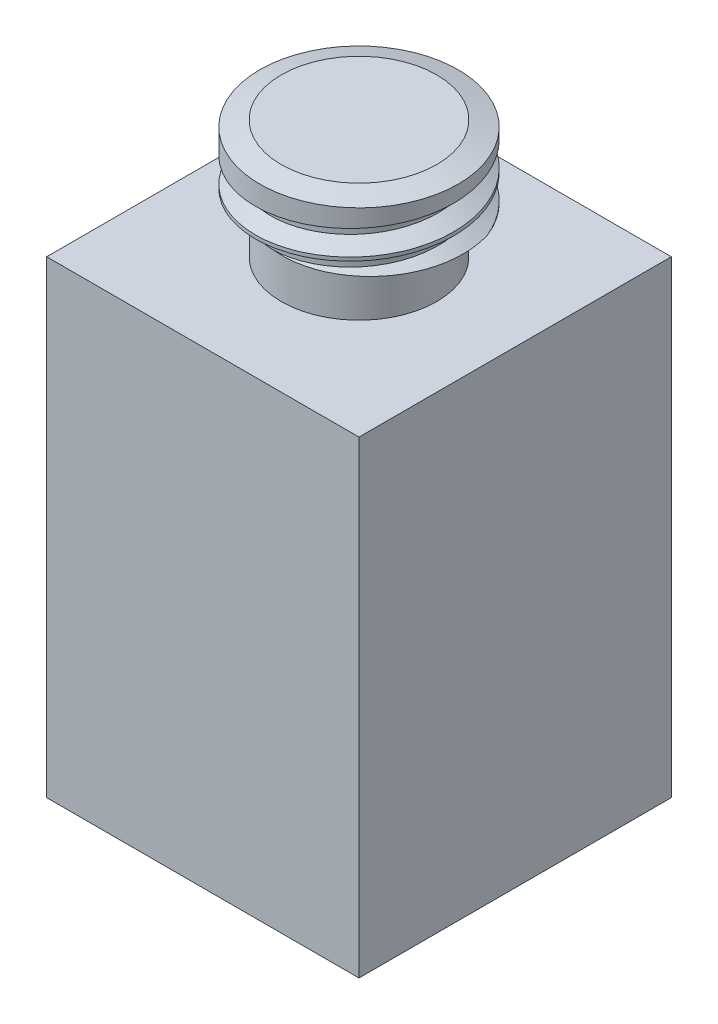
ISO-10303-21;
HEADER;
FILE_DESCRIPTION(('STEP AP214'),'2;1');
FILE_NAME('part.step','',(''),(''),'','','');
FILE_SCHEMA(('AUTOMOTIVE_DESIGN { 1 0 10303 214 1 1 1 1 }'));
ENDSEC;
DATA;
#1=APPLICATION_CONTEXT('core data for automotive mechanical design processes');
#2=APPLICATION_PROTOCOL_DEFINITION('international standard','automotive_design',2000,#1);
#3=PRODUCT_CONTEXT('',#1,'mechanical');
#4=PRODUCT('Part','Part','',(#3));
#5=PRODUCT_RELATED_PRODUCT_CATEGORY('part','',(#4));
#6=PRODUCT_DEFINITION_FORMATION('','',#4);
#7=PRODUCT_DEFINITION_CONTEXT('part definition',#1,'design');
#8=PRODUCT_DEFINITION('design','',#6,#7);
#9=PRODUCT_DEFINITION_SHAPE('','',#8);
#10=(LENGTH_UNIT() NAMED_UNIT(*) SI_UNIT(.MILLI.,.METRE.));
#11=(NAMED_UNIT(*) PLANE_ANGLE_UNIT() SI_UNIT($,.RADIAN.));
#12=(NAMED_UNIT(*) SI_UNIT($,.STERADIAN.) SOLID_ANGLE_UNIT());
#13=UNCERTAINTY_MEASURE_WITH_UNIT(LENGTH_MEASURE(1.E-05),#10,'distance_accuracy_value','');
#14=(GEOMETRIC_REPRESENTATION_CONTEXT(3) GLOBAL_UNCERTAINTY_ASSIGNED_CONTEXT((#13)) GLOBAL_UNIT_ASSIGNED_CONTEXT((#10,
#11,#12)) REPRESENTATION_CONTEXT('',''));
#15=CARTESIAN_POINT('',(0.,0.,0.));
#16=DIRECTION('',(0.,0.,1.));
#17=DIRECTION('',(1.,0.,0.));
#18=AXIS2_PLACEMENT_3D('',#15,#16,#17);
#19=CARTESIAN_POINT('',(0.,16.5,0.));
#20=DIRECTION('',(0.,1.,0.));
#21=DIRECTION('',(0.,0.,1.));
#22=AXIS2_PLACEMENT_3D('',#19,#20,#21);
#23=PLANE('',#22);
#24=CARTESIAN_POINT('',(0.,16.5,0.));
#25=DIRECTION('',(0.,1.,0.));
#26=DIRECTION('',(0.,0.,1.));
#27=AXIS2_PLACEMENT_3D('',#24,#25,#26);
#28=CIRCLE('',#27,2.4892);
#29=CARTESIAN_POINT('',(0.,16.5,2.4892));
#30=VERTEX_POINT('',#29);
#31=EDGE_CURVE('E161',#30,#30,#28,.T.);
#32=ORIENTED_EDGE('',*,*,#31,.T.);
#33=EDGE_LOOP('',(#32));
#34=FACE_BOUND('',#33,.T.);
#35=CARTESIAN_POINT('',(1.25907616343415,16.5,-2.91467874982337));
#36=CARTESIAN_POINT('',(1.17500574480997,16.5,-2.94321576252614));
#37=CARTESIAN_POINT('',(1.08972726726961,16.5,-2.9681925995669));
#38=CARTESIAN_POINT('',(0.917386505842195,16.5,-3.01088530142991));
#39=CARTESIAN_POINT('',(0.83032451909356,16.5,-3.02860236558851));
#40=CARTESIAN_POINT('',(0.654842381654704,16.5,-3.05667297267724));
#41=CARTESIAN_POINT('',(0.566419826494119,16.5,-3.0670114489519));
#42=CARTESIAN_POINT('',(0.388996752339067,16.5,-3.0802008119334));
#43=CARTESIAN_POINT('',(0.299996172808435,16.5,-3.08305090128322));
#44=CARTESIAN_POINT('',(0.166504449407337,16.5,-3.08168500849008));
#45=CARTESIAN_POINT('',(0.121967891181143,16.5,-3.08028566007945));
#46=CARTESIAN_POINT('',(0.0329930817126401,16.5,-3.0756239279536));
#47=CARTESIAN_POINT('',(-0.0114451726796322,16.5,-3.07236160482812));
#48=CARTESIAN_POINT('',(-0.144460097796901,16.5,-3.05957565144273));
#49=CARTESIAN_POINT('',(-0.23276865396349,16.5,-3.0470528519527));
#50=CARTESIAN_POINT('',(-0.407760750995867,16.5,-3.01414433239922));
#51=CARTESIAN_POINT('',(-0.494446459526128,16.5,-2.99377002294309));
#52=CARTESIAN_POINT('',(-0.665648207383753,16.5,-2.94531083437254));
#53=CARTESIAN_POINT('',(-0.750164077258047,16.5,-2.91722535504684));
#54=CARTESIAN_POINT('',(-0.912140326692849,16.5,-2.85517508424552));
#55=CARTESIAN_POINT('',(-0.989741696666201,16.5,-2.82157748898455));
#56=CARTESIAN_POINT('',(-1.14179099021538,16.5,-2.74787775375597));
#57=CARTESIAN_POINT('',(-1.21623898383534,16.5,-2.70777575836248));
#58=CARTESIAN_POINT('',(-1.36150337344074,16.5,-2.62131996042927));
#59=CARTESIAN_POINT('',(-1.4323164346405,16.5,-2.57496055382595));
#60=CARTESIAN_POINT('',(-1.56972323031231,16.5,-2.4763546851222));
#61=CARTESIAN_POINT('',(-1.6363166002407,16.5,-2.42410771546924));
#62=CARTESIAN_POINT('',(-1.76395276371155,16.5,-2.31483573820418));
#63=CARTESIAN_POINT('',(-1.82505738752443,16.5,-2.25788317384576));
#64=CARTESIAN_POINT('',(-1.91292405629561,16.5,-2.16875391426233));
#65=CARTESIAN_POINT('',(-1.94158341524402,16.5,-2.13842480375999));
#66=CARTESIAN_POINT('',(-1.99761585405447,16.5,-2.07659725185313));
#67=CARTESIAN_POINT('',(-2.02498895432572,16.5,-2.04509882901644));
#68=CARTESIAN_POINT('',(-2.07828274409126,16.5,-1.98093632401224));
#69=CARTESIAN_POINT('',(-2.10420456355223,16.5,-1.94827318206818));
#70=CARTESIAN_POINT('',(-2.15454265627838,16.5,-1.88181083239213));
#71=CARTESIAN_POINT('',(-2.17895893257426,16.5,-1.84801162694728));
#72=CARTESIAN_POINT('',(-2.24987851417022,16.5,-1.74501904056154));
#73=CARTESIAN_POINT('',(-2.29406935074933,16.5,-1.67421048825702));
#74=CARTESIAN_POINT('',(-2.37449276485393,16.5,-1.53136495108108));
#75=CARTESIAN_POINT('',(-2.41094382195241,16.5,-1.45945035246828));
#76=CARTESIAN_POINT('',(-2.47744205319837,16.5,-1.31270795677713));
#77=CARTESIAN_POINT('',(-2.50748870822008,16.5,-1.23787992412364));
#78=CARTESIAN_POINT('',(-2.56093532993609,16.5,-1.08589769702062));
#79=CARTESIAN_POINT('',(-2.58433624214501,16.5,-1.00874383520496));
#80=CARTESIAN_POINT('',(-2.62432322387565,16.5,-0.852683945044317));
#81=CARTESIAN_POINT('',(-2.6409082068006,16.5,-0.773777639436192));
#82=CARTESIAN_POINT('',(-2.6717338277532,16.5,-0.586839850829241));
#83=CARTESIAN_POINT('',(-2.68309990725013,16.5,-0.478322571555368));
#84=CARTESIAN_POINT('',(-2.69299228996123,16.5,-0.260914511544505));
#85=CARTESIAN_POINT('',(-2.69154320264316,16.5,-0.152024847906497));
#86=CARTESIAN_POINT('',(-2.68364000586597,16.5,-0.0436227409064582));
#87=B_SPLINE_CURVE_WITH_KNOTS('',3,(#35,#36,#37,#38,#39,#40,#41,#42,#43,#44,#45,#46,#47,#48,#49,
#50,#51,#52,#53,#54,#55,#56,#57,#58,#59,#60,#61,#62,#63,#64,#65,#66,#67,#68,#69,#70,#71,#72,#73,
#74,#75,#76,#77,#78,#79,#80,#81,#82,#83,#84,#85,#86),.UNSPECIFIED.,.F.,.F.,(4,2,2,2,2,2,2,2,2,2,
2,2,2,2,2,2,2,2,2,2,2,2,2,2,2,4),(0.,0.266266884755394,0.532489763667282,0.799254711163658,
1.06604806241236,1.19969009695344,1.33332778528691,1.60050833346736,1.8673020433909,
2.13411652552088,2.3874977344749,2.6408733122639,2.89447733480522,3.1481032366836,
3.39837017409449,3.52352403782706,3.64867591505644,3.77372895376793,3.89878174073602,
4.14880881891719,4.39038619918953,4.63198315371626,4.87354571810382,5.1151467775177,
5.44169492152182,5.76761611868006),.UNSPECIFIED.);
#88=CARTESIAN_POINT('',(1.25907616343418,16.5,-2.91467874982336));
#89=VERTEX_POINT('',#88);
#90=CARTESIAN_POINT('',(-2.68364000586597,16.5,-0.0436227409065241));
#91=VERTEX_POINT('',#90);
#92=EDGE_CURVE('E12',#89,#91,#87,.T.);
#93=ORIENTED_EDGE('',*,*,#92,.F.);
#94=CARTESIAN_POINT('',(0.,16.5,0.));
#95=DIRECTION('',(0.,1.,0.));
#96=DIRECTION('',(0.,0.,1.));
#97=AXIS2_PLACEMENT_3D('',#94,#95,#96);
#98=CIRCLE('',#97,3.175);
#99=CARTESIAN_POINT('',(2.95129042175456,16.5,-1.17068776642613));
#100=VERTEX_POINT('',#99);
#101=EDGE_CURVE('E160',#100,#89,#98,.T.);
#102=ORIENTED_EDGE('',*,*,#101,.F.);
#103=CARTESIAN_POINT('',(-0.0436227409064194,16.5,2.68364000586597));
#104=CARTESIAN_POINT('',(0.0336142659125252,16.5,2.69169989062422));
#105=CARTESIAN_POINT('',(0.111155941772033,16.5,2.69650462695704));
#106=CARTESIAN_POINT('',(0.266367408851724,16.5,2.6995978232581));
#107=CARTESIAN_POINT('',(0.344037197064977,16.5,2.69788643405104));
#108=CARTESIAN_POINT('',(0.57633765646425,16.5,2.68298129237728));
#109=CARTESIAN_POINT('',(0.730445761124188,16.5,2.66003578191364));
#110=CARTESIAN_POINT('',(1.03269970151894,16.5,2.58867268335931));
#111=CARTESIAN_POINT('',(1.18084372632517,16.5,2.54024742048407));
#112=CARTESIAN_POINT('',(1.39526813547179,16.5,2.44967094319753));
#113=CARTESIAN_POINT('',(1.46545263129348,16.5,2.41648374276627));
#114=CARTESIAN_POINT('',(1.60280632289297,16.5,2.34434836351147));
#115=CARTESIAN_POINT('',(1.66997579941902,16.5,2.30540072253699));
#116=CARTESIAN_POINT('',(1.80110620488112,16.5,2.2218404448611));
#117=CARTESIAN_POINT('',(1.86505211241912,16.5,2.17720419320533));
#118=CARTESIAN_POINT('',(1.95797328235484,16.5,2.10634418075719));
#119=CARTESIAN_POINT('',(1.98845164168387,16.5,2.08206938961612));
#120=CARTESIAN_POINT('',(2.04837410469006,16.5,2.03227438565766));
#121=CARTESIAN_POINT('',(2.077818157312,16.5,2.00675411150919));
#122=CARTESIAN_POINT('',(2.16467259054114,16.5,1.92845649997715));
#123=CARTESIAN_POINT('',(2.22056470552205,16.5,1.87397356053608));
#124=CARTESIAN_POINT('',(2.32786738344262,16.5,1.76079554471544));
#125=CARTESIAN_POINT('',(2.37927798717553,16.5,1.70210050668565));
#126=CARTESIAN_POINT('',(2.53037716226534,16.5,1.51521486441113));
#127=CARTESIAN_POINT('',(2.62217394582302,16.5,1.38049179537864));
#128=CARTESIAN_POINT('',(2.78243348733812,16.5,1.09797681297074));
#129=CARTESIAN_POINT('',(2.85091591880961,16.5,0.950196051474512));
#130=CARTESIAN_POINT('',(2.93567916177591,16.5,0.719574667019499));
#131=CARTESIAN_POINT('',(2.96116706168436,16.5,0.640010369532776));
#132=CARTESIAN_POINT('',(3.00536420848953,16.5,0.479010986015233));
#133=CARTESIAN_POINT('',(3.02407397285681,16.5,0.397576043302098));
#134=CARTESIAN_POINT('',(3.05460645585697,16.5,0.233316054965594));
#135=CARTESIAN_POINT('',(3.06642080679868,16.5,0.150489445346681));
#136=CARTESIAN_POINT('',(3.07886127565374,16.5,0.0257458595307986));
#137=CARTESIAN_POINT('',(3.08212798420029,16.5,-0.0159234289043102));
#138=CARTESIAN_POINT('',(3.08701897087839,16.5,-0.099368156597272));
#139=CARTESIAN_POINT('',(3.08864282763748,16.5,-0.141143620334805));
#140=CARTESIAN_POINT('',(3.09103024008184,16.5,-0.266451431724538));
#141=CARTESIAN_POINT('',(3.08931745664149,16.5,-0.350044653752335));
#142=CARTESIAN_POINT('',(3.07929593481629,16.5,-0.51682348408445));
#143=CARTESIAN_POINT('',(3.07098732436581,16.5,-0.600009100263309));
#144=CARTESIAN_POINT('',(3.04784365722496,16.5,-0.765309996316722));
#145=CARTESIAN_POINT('',(3.03302091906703,16.5,-0.847426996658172));
#146=CARTESIAN_POINT('',(2.99695013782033,16.5,-1.01024797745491));
#147=CARTESIAN_POINT('',(2.97570129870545,16.5,-1.09095178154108));
#148=CARTESIAN_POINT('',(2.95129042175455,16.5,-1.17068776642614));
#149=B_SPLINE_CURVE_WITH_KNOTS('',3,(#103,#104,#105,#106,#107,#108,#109,#110,#111,#112,#113,
#114,#115,#116,#117,#118,#119,#120,#121,#122,#123,#124,#125,#126,#127,#128,#129,#130,#131,#132,
#133,#134,#135,#136,#137,#138,#139,#140,#141,#142,#143,#144,#145,#146,#147,#148),.UNSPECIFIED.,
.F.,.F.,(4,2,2,2,2,2,2,2,2,2,2,2,2,2,2,2,2,2,2,2,2,2,4),(0.,0.2328317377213,0.465658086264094,
0.930755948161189,1.39599398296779,1.62867125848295,1.8613268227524,2.0949817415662,
2.21184349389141,2.32871100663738,2.56259906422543,2.79648499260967,3.28321590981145,
3.76953508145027,4.01992395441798,4.27029370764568,4.52096666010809,4.64632794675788,
4.77172137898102,5.02226940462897,5.27281257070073,5.52288397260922,5.77298636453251),.UNSPECIFIED.);
#150=CARTESIAN_POINT('',(-0.0436227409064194,16.5,2.68364000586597));
#151=VERTEX_POINT('',#150);
#152=EDGE_CURVE('E92',#151,#100,#149,.T.);
#153=ORIENTED_EDGE('',*,*,#152,.F.);
#154=CARTESIAN_POINT('',(-2.68364000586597,16.5,-0.0436227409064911));
#155=CARTESIAN_POINT('',(-2.68487349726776,16.5,0.0322819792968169));
#156=CARTESIAN_POINT('',(-2.6828847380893,16.5,0.108202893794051));
#157=CARTESIAN_POINT('',(-2.67247925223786,16.5,0.259741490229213));
#158=CARTESIAN_POINT('',(-2.66405085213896,16.5,0.335358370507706));
#159=CARTESIAN_POINT('',(-2.62934789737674,16.5,0.55950210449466));
#160=CARTESIAN_POINT('',(-2.59367572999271,16.5,0.706684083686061));
#161=CARTESIAN_POINT('',(-2.49810894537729,16.5,0.993032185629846));
#162=CARTESIAN_POINT('',(-2.43819178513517,16.5,1.13219071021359));
#163=CARTESIAN_POINT('',(-2.29585590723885,16.5,1.39844141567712));
#164=CARTESIAN_POINT('',(-2.21344492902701,16.5,1.52553772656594));
#165=CARTESIAN_POINT('',(-2.02847593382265,16.5,1.76405402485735));
#166=CARTESIAN_POINT('',(-1.92592283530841,16.5,1.87547782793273));
#167=CARTESIAN_POINT('',(-1.70358351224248,16.5,2.07951776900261));
#168=CARTESIAN_POINT('',(-1.58379949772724,16.5,2.17213631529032));
#169=CARTESIAN_POINT('',(-1.33031519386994,16.5,2.3359943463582));
#170=CARTESIAN_POINT('',(-1.19660797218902,16.5,2.40722311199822));
#171=CARTESIAN_POINT('',(-0.919040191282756,16.5,2.52626849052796));
#172=CARTESIAN_POINT('',(-0.775171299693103,16.5,2.57406562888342));
#173=CARTESIAN_POINT('',(-0.481671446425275,16.5,2.64471326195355));
#174=CARTESIAN_POINT('',(-0.332053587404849,16.5,2.66761736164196));
#175=CARTESIAN_POINT('',(-0.135748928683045,16.5,2.68096051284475));
#176=CARTESIAN_POINT('',(-0.0896844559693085,16.5,2.68289883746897));
#177=CARTESIAN_POINT('',(-0.0436227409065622,16.5,2.68364000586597));
#178=B_SPLINE_CURVE_WITH_KNOTS('',3,(#154,#155,#156,#157,#158,#159,#160,#161,#162,#163,#164,
#165,#166,#167,#168,#169,#170,#171,#172,#173,#174,#175,#176,#177),.UNSPECIFIED.,.F.,.F.,(4,2,2,
2,2,2,2,2,2,2,2,4),(0.,0.227604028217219,0.455621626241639,0.907622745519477,1.36004510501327,
1.81231199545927,2.26446858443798,2.71656723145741,3.16889206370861,3.62159219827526,
4.07331553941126,4.21156386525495),.UNSPECIFIED.);
#179=EDGE_CURVE('E59',#91,#151,#178,.T.);
#180=ORIENTED_EDGE('',*,*,#179,.F.);
#181=EDGE_LOOP('',(#93,#102,#153,#180));
#182=FACE_BOUND('',#181,.T.);
#183=ADVANCED_FACE('F47',(#34,#182),#23,.F.);
#184=CARTESIAN_POINT('',(5.,15.,-5.));
#185=DIRECTION('',(-1.,0.,0.));
#186=DIRECTION('',(0.,0.,1.));
#187=AXIS2_PLACEMENT_3D('',#184,#185,#186);
#188=PLANE('',#187);
#189=DIRECTION('',(0.,0.,-1.));
#190=VECTOR('',#189,1.);
#191=CARTESIAN_POINT('',(5.,0.,-5.));
#192=LINE('',#191,#190);
#193=CARTESIAN_POINT('',(5.,0.,5.));
#194=VERTEX_POINT('',#193);
#195=CARTESIAN_POINT('',(5.,0.,-5.));
#196=VERTEX_POINT('',#195);
#197=EDGE_CURVE('E174',#194,#196,#192,.T.);
#198=ORIENTED_EDGE('',*,*,#197,.T.);
#199=DIRECTION('',(0.,-1.,0.));
#200=VECTOR('',#199,1.);
#201=CARTESIAN_POINT('',(5.,15.,-5.));
#202=LINE('',#201,#200);
#203=CARTESIAN_POINT('',(5.,15.,-5.));
#204=VERTEX_POINT('',#203);
#205=EDGE_CURVE('E168',#204,#196,#202,.T.);
#206=ORIENTED_EDGE('',*,*,#205,.F.);
#207=DIRECTION('',(0.,0.,-1.));
#208=VECTOR('',#207,1.);
#209=CARTESIAN_POINT('',(5.,15.,-5.));
#210=LINE('',#209,#208);
#211=CARTESIAN_POINT('',(5.,15.,5.));
#212=VERTEX_POINT('',#211);
#213=EDGE_CURVE('E175',#212,#204,#210,.T.);
#214=ORIENTED_EDGE('',*,*,#213,.F.);
#215=DIRECTION('',(0.,-1.,0.));
#216=VECTOR('',#215,1.);
#217=CARTESIAN_POINT('',(5.,15.,5.));
#218=LINE('',#217,#216);
#219=EDGE_CURVE('E187',#212,#194,#218,.T.);
#220=ORIENTED_EDGE('',*,*,#219,.T.);
#221=EDGE_LOOP('',(#198,#206,#214,#220));
#222=FACE_BOUND('',#221,.T.);
#223=ADVANCED_FACE('F49',(#222),#188,.F.);
#224=CARTESIAN_POINT('',(-5.,15.,-5.));
#225=DIRECTION('',(0.,0.,1.));
#226=DIRECTION('',(1.,0.,0.));
#227=AXIS2_PLACEMENT_3D('',#224,#225,#226);
#228=PLANE('',#227);
#229=DIRECTION('',(-1.,0.,0.));
#230=VECTOR('',#229,1.);
#231=CARTESIAN_POINT('',(-5.,0.,-5.));
#232=LINE('',#231,#230);
#233=CARTESIAN_POINT('',(-5.,0.,-5.));
#234=VERTEX_POINT('',#233);
#235=EDGE_CURVE('E190',#196,#234,#232,.T.);
#236=ORIENTED_EDGE('',*,*,#235,.T.);
#237=DIRECTION('',(0.,-1.,0.));
#238=VECTOR('',#237,1.);
#239=CARTESIAN_POINT('',(-5.,15.,-5.));
#240=LINE('',#239,#238);
#241=CARTESIAN_POINT('',(-5.,15.,-5.));
#242=VERTEX_POINT('',#241);
#243=EDGE_CURVE('E203',#242,#234,#240,.T.);
#244=ORIENTED_EDGE('',*,*,#243,.F.);
#245=DIRECTION('',(-1.,0.,0.));
#246=VECTOR('',#245,1.);
#247=CARTESIAN_POINT('',(-5.,15.,-5.));
#248=LINE('',#247,#246);
#249=EDGE_CURVE('E178',#204,#242,#248,.T.);
#250=ORIENTED_EDGE('',*,*,#249,.F.);
#251=ORIENTED_EDGE('',*,*,#205,.T.);
#252=EDGE_LOOP('',(#236,#244,#250,#251));
#253=FACE_BOUND('',#252,.T.);
#254=ADVANCED_FACE('F285',(#253),#228,.F.);
#255=CARTESIAN_POINT('',(-5.,15.,-5.));
#256=DIRECTION('',(1.,0.,0.));
#257=DIRECTION('',(0.,0.,-1.));
#258=AXIS2_PLACEMENT_3D('',#255,#256,#257);
#259=PLANE('',#258);
#260=DIRECTION('',(0.,0.,1.));
#261=VECTOR('',#260,1.);
#262=CARTESIAN_POINT('',(-5.,0.,-5.));
#263=LINE('',#262,#261);
#264=CARTESIAN_POINT('',(-5.,0.,5.));
#265=VERTEX_POINT('',#264);
#266=EDGE_CURVE('E193',#234,#265,#263,.T.);
#267=ORIENTED_EDGE('',*,*,#266,.T.);
#268=DIRECTION('',(0.,-1.,0.));
#269=VECTOR('',#268,1.);
#270=CARTESIAN_POINT('',(-5.,15.,5.));
#271=LINE('',#270,#269);
#272=CARTESIAN_POINT('',(-5.,15.,5.));
#273=VERTEX_POINT('',#272);
#274=EDGE_CURVE('E200',#273,#265,#271,.T.);
#275=ORIENTED_EDGE('',*,*,#274,.F.);
#276=DIRECTION('',(0.,0.,1.));
#277=VECTOR('',#276,1.);
#278=CARTESIAN_POINT('',(-5.,15.,-5.));
#279=LINE('',#278,#277);
#280=EDGE_CURVE('E182',#242,#273,#279,.T.);
#281=ORIENTED_EDGE('',*,*,#280,.F.);
#282=ORIENTED_EDGE('',*,*,#243,.T.);
#283=EDGE_LOOP('',(#267,#275,#281,#282));
#284=FACE_BOUND('',#283,.T.);
#285=ADVANCED_FACE('F289',(#284),#259,.F.);
#286=CARTESIAN_POINT('',(-5.,15.,5.));
#287=DIRECTION('',(0.,0.,-1.));
#288=DIRECTION('',(-1.,0.,0.));
#289=AXIS2_PLACEMENT_3D('',#286,#287,#288);
#290=PLANE('',#289);
#291=DIRECTION('',(1.,0.,0.));
#292=VECTOR('',#291,1.);
#293=CARTESIAN_POINT('',(-5.,0.,5.));
#294=LINE('',#293,#292);
#295=EDGE_CURVE('E179',#265,#194,#294,.T.);
#296=ORIENTED_EDGE('',*,*,#295,.T.);
#297=ORIENTED_EDGE('',*,*,#219,.F.);
#298=DIRECTION('',(1.,0.,0.));
#299=VECTOR('',#298,1.);
#300=CARTESIAN_POINT('',(-5.,15.,5.));
#301=LINE('',#300,#299);
#302=EDGE_CURVE('E185',#273,#212,#301,.T.);
#303=ORIENTED_EDGE('',*,*,#302,.F.);
#304=ORIENTED_EDGE('',*,*,#274,.T.);
#305=EDGE_LOOP('',(#296,#297,#303,#304));
#306=FACE_BOUND('',#305,.T.);
#307=ADVANCED_FACE('F275',(#306),#290,.F.);
#308=CARTESIAN_POINT('',(0.,15.,0.));
#309=DIRECTION('',(0.,1.,0.));
#310=DIRECTION('',(0.,0.,1.));
#311=AXIS2_PLACEMENT_3D('',#308,#309,#310);
#312=PLANE('',#311);
#313=CARTESIAN_POINT('',(0.,15.,0.));
#314=DIRECTION('',(0.,1.,0.));
#315=DIRECTION('',(0.,0.,1.));
#316=AXIS2_PLACEMENT_3D('',#313,#314,#315);
#317=CIRCLE('',#316,2.4892);
#318=CARTESIAN_POINT('',(0.,15.,2.4892));
#319=VERTEX_POINT('',#318);
#320=EDGE_CURVE('E165',#319,#319,#317,.T.);
#321=ORIENTED_EDGE('',*,*,#320,.F.);
#322=EDGE_LOOP('',(#321));
#323=FACE_BOUND('',#322,.T.);
#324=ORIENTED_EDGE('',*,*,#213,.T.);
#325=ORIENTED_EDGE('',*,*,#249,.T.);
#326=ORIENTED_EDGE('',*,*,#280,.T.);
#327=ORIENTED_EDGE('',*,*,#302,.T.);
#328=EDGE_LOOP('',(#324,#325,#326,#327));
#329=FACE_BOUND('',#328,.T.);
#330=ADVANCED_FACE('F288',(#323,#329),#312,.T.);
#331=CARTESIAN_POINT('',(0.,0.,0.));
#332=DIRECTION('',(0.,1.,0.));
#333=DIRECTION('',(0.,0.,1.));
#334=AXIS2_PLACEMENT_3D('',#331,#332,#333);
#335=PLANE('',#334);
#336=CARTESIAN_POINT('',(0.,0.,0.));
#337=DIRECTION('',(0.,-1.,0.));
#338=DIRECTION('',(0.,0.,-1.));
#339=AXIS2_PLACEMENT_3D('',#336,#337,#338);
#340=CIRCLE('',#339,1.72719999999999);
#341=CARTESIAN_POINT('',(0.,0.,-1.72719999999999));
#342=VERTEX_POINT('',#341);
#343=EDGE_CURVE('E164',#342,#342,#340,.T.);
#344=ORIENTED_EDGE('',*,*,#343,.F.);
#345=EDGE_LOOP('',(#344));
#346=FACE_BOUND('',#345,.T.);
#347=ORIENTED_EDGE('',*,*,#197,.F.);
#348=ORIENTED_EDGE('',*,*,#295,.F.);
#349=ORIENTED_EDGE('',*,*,#266,.F.);
#350=ORIENTED_EDGE('',*,*,#235,.F.);
#351=EDGE_LOOP('',(#347,#348,#349,#350));
#352=FACE_BOUND('',#351,.T.);
#353=ADVANCED_FACE('F282',(#346,#352),#335,.F.);
#354=CARTESIAN_POINT('',(0.,5.5,0.));
#355=DIRECTION('',(0.,-1.,0.));
#356=DIRECTION('',(0.,0.,-1.));
#357=AXIS2_PLACEMENT_3D('',#354,#355,#356);
#358=CONICAL_SURFACE('',#357,1.7272,1.02974425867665);
#359=CARTESIAN_POINT('',(0.,6.5378064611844,0.));
#360=VERTEX_POINT('',#359);
#361=VERTEX_LOOP('',#360);
#362=FACE_BOUND('',#361,.T.);
#363=CARTESIAN_POINT('',(0.,5.5,0.));
#364=DIRECTION('',(0.,-1.,0.));
#365=DIRECTION('',(0.,0.,-1.));
#366=AXIS2_PLACEMENT_3D('',#363,#364,#365);
#367=CIRCLE('',#366,1.7272);
#368=CARTESIAN_POINT('',(0.,5.5,-1.7272));
#369=VERTEX_POINT('',#368);
#370=EDGE_CURVE('E171',#369,#369,#367,.T.);
#371=ORIENTED_EDGE('',*,*,#370,.T.);
#372=EDGE_LOOP('',(#371));
#373=FACE_BOUND('',#372,.T.);
#374=ADVANCED_FACE('F405',(#362,#373),#358,.F.);
#375=CARTESIAN_POINT('',(0.,0.,0.));
#376=DIRECTION('',(0.,-1.,0.));
#377=DIRECTION('',(0.,0.,-1.));
#378=AXIS2_PLACEMENT_3D('',#375,#376,#377);
#379=CYLINDRICAL_SURFACE('',#378,1.72719999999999);
#380=ORIENTED_EDGE('',*,*,#370,.F.);
#381=EDGE_LOOP('',(#380));
#382=FACE_BOUND('',#381,.T.);
#383=ORIENTED_EDGE('',*,*,#343,.T.);
#384=EDGE_LOOP('',(#383));
#385=FACE_BOUND('',#384,.T.);
#386=ADVANCED_FACE('F395',(#382,#385),#379,.F.);
#387=CARTESIAN_POINT('',(0.,16.5,0.));
#388=DIRECTION('',(0.,-1.,0.));
#389=DIRECTION('',(0.,0.,-1.));
#390=AXIS2_PLACEMENT_3D('',#387,#388,#389);
#391=CYLINDRICAL_SURFACE('',#390,2.4892);
#392=ORIENTED_EDGE('',*,*,#31,.F.);
#393=EDGE_LOOP('',(#392));
#394=FACE_BOUND('',#393,.T.);
#395=ORIENTED_EDGE('',*,*,#320,.T.);
#396=EDGE_LOOP('',(#395));
#397=FACE_BOUND('',#396,.T.);
#398=ADVANCED_FACE('F318',(#394,#397),#391,.T.);
#399=CARTESIAN_POINT('',(0.,18.6,0.));
#400=DIRECTION('',(0.,-1.,0.));
#401=DIRECTION('',(0.,0.,-1.));
#402=AXIS2_PLACEMENT_3D('',#399,#400,#401);
#403=CYLINDRICAL_SURFACE('',#402,3.175);
#404=ORIENTED_EDGE('',*,*,#101,.T.);
#405=CARTESIAN_POINT('',(-3.175,18.6,0.));
#406=CARTESIAN_POINT('',(-3.175,18.5433035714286,-1.31512806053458));
#407=CARTESIAN_POINT('',(-2.24506403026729,18.4866071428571,-2.24506403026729));
#408=CARTESIAN_POINT('',(-1.31512806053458,18.4299107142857,-3.175));
#409=CARTESIAN_POINT('',(0.,18.3732142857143,-3.175));
#410=CARTESIAN_POINT('',(1.31512806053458,18.3165178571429,-3.175));
#411=CARTESIAN_POINT('',(2.24506403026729,18.2598214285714,-2.24506403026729));
#412=CARTESIAN_POINT('',(3.175,18.203125,-1.31512806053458));
#413=CARTESIAN_POINT('',(3.175,18.1464285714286,0.));
#414=CARTESIAN_POINT('',(3.175,18.0897321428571,1.31512806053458));
#415=CARTESIAN_POINT('',(2.24506403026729,18.0330357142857,2.24506403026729));
#416=CARTESIAN_POINT('',(1.31512806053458,17.9763392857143,3.175));
#417=CARTESIAN_POINT('',(0.,17.9196428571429,3.175));
#418=CARTESIAN_POINT('',(-1.31512806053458,17.8629464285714,3.175));
#419=CARTESIAN_POINT('',(-2.24506403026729,17.80625,2.24506403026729));
#420=CARTESIAN_POINT('',(-3.175,17.7495535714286,1.31512806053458));
#421=CARTESIAN_POINT('',(-3.175,17.6928571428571,0.));
#422=CARTESIAN_POINT('',(-3.175,17.6361607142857,-1.31512806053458));
#423=CARTESIAN_POINT('',(-2.24506403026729,17.5794642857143,-2.24506403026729));
#424=CARTESIAN_POINT('',(-1.31512806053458,17.5227678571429,-3.175));
#425=CARTESIAN_POINT('',(0.,17.4660714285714,-3.175));
#426=CARTESIAN_POINT('',(1.31512806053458,17.409375,-3.175));
#427=CARTESIAN_POINT('',(2.24506403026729,17.3526785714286,-2.24506403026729));
#428=CARTESIAN_POINT('',(3.175,17.2959821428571,-1.31512806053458));
#429=CARTESIAN_POINT('',(3.175,17.2392857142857,0.));
#430=CARTESIAN_POINT('',(3.175,17.1825892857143,1.31512806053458));
#431=CARTESIAN_POINT('',(2.24506403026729,17.1258928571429,2.24506403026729));
#432=CARTESIAN_POINT('',(1.31512806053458,17.0691964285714,3.175));
#433=CARTESIAN_POINT('',(0.,17.0125,3.175));
#434=CARTESIAN_POINT('',(-1.31512806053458,16.9558035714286,3.175));
#435=CARTESIAN_POINT('',(-2.24506403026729,16.8991071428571,2.24506403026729));
#436=CARTESIAN_POINT('',(-3.175,16.8424107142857,1.31512806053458));
#437=CARTESIAN_POINT('',(-3.175,16.7857142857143,0.));
#438=CARTESIAN_POINT('',(-3.175,16.7290178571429,-1.31512806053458));
#439=CARTESIAN_POINT('',(-2.24506403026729,16.6723214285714,-2.24506403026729));
#440=CARTESIAN_POINT('',(-1.31512806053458,16.615625,-3.175));
#441=CARTESIAN_POINT('',(0.,16.5589285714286,-3.175));
#442=CARTESIAN_POINT('',(1.31512806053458,16.5022321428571,-3.175));
#443=CARTESIAN_POINT('',(2.24506403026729,16.4455357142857,-2.24506403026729));
#444=CARTESIAN_POINT('',(3.175,16.3888392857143,-1.31512806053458));
#445=CARTESIAN_POINT('',(3.175,16.3321428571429,0.));
#446=CARTESIAN_POINT('',(3.175,16.3168422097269,0.354913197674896));
#447=CARTESIAN_POINT('',(3.09663224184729,16.3005198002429,0.701066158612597));
#448=(BOUNDED_CURVE() B_SPLINE_CURVE(2,(#405,#406,#407,#408,#409,#410,#411,#412,#413,#414,#415,
#416,#417,#418,#419,#420,#421,#422,#423,#424,#425,#426,#427,#428,#429,#430,#431,#432,#433,#434,
#435,#436,#437,#438,#439,#440,#441,#442,#443,#444,#445,#446,#447),.UNSPECIFIED.,.F.,
.F.) B_SPLINE_CURVE_WITH_KNOTS((3,2,2,2,2,2,2,2,2,2,2,2,2,2,2,2,2,2,2,2,2,3),(0.,
0.0416666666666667,0.0833333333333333,0.125,0.166666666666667,0.208333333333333,0.25,
0.291666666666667,0.333333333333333,0.375,0.416666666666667,0.458333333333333,0.5,
0.541666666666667,0.583333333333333,0.625,0.666666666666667,0.708333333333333,0.75,
0.791666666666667,0.833333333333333,0.845239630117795),
.UNSPECIFIED.) CURVE() GEOMETRIC_REPRESENTATION_ITEM() RATIONAL_B_SPLINE_CURVE((1.,
0.923879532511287,1.,0.923879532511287,1.,0.923879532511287,1.,0.923879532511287,1.,
0.923879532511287,1.,0.923879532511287,1.,0.923879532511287,1.,0.923879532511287,1.,
0.923879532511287,1.,0.923879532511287,1.,0.923879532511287,1.,0.923879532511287,1.,
0.923879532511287,1.,0.923879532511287,1.,0.923879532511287,1.,0.923879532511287,1.,
0.923879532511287,1.,0.923879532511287,1.,0.923879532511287,1.,0.923879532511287,1.,
0.978248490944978,0.968928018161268)) REPRESENTATION_ITEM(''));
#449=CARTESIAN_POINT('',(-3.175,18.6,0.));
#450=VERTEX_POINT('',#449);
#451=EDGE_CURVE('E97',#450,#89,#448,.T.);
#452=ORIENTED_EDGE('',*,*,#451,.F.);
#453=CARTESIAN_POINT('',(0.,18.6,0.));
#454=DIRECTION('',(0.,1.,0.));
#455=DIRECTION('',(0.,0.,1.));
#456=AXIS2_PLACEMENT_3D('',#453,#454,#455);
#457=CIRCLE('',#456,3.175);
#458=EDGE_CURVE('E111',#450,#450,#457,.T.);
#459=ORIENTED_EDGE('',*,*,#458,.F.);
#460=CARTESIAN_POINT('',(-3.175,18.6,0.));
#461=CARTESIAN_POINT('',(-3.175,17.8062500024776,0.));
#462=(BOUNDED_CURVE() B_SPLINE_CURVE(1,(#460,#461),.UNSPECIFIED.,.F.,
.F.) B_SPLINE_CURVE_WITH_KNOTS((2,2),(0.,1.),
.UNSPECIFIED.) CURVE() GEOMETRIC_REPRESENTATION_ITEM() RATIONAL_B_SPLINE_CURVE((1.,1.)) REPRESENTATION_ITEM(''));
#463=CARTESIAN_POINT('',(-3.175,17.8062500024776,0.));
#464=VERTEX_POINT('',#463);
#465=EDGE_CURVE('E98',#450,#464,#462,.T.);
#466=ORIENTED_EDGE('',*,*,#465,.T.);
#467=CARTESIAN_POINT('',(-3.175,17.8062500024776,0.));
#468=CARTESIAN_POINT('',(-3.175,17.7495535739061,-1.31512806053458));
#469=CARTESIAN_POINT('',(-2.24506403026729,17.6928571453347,-2.24506403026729));
#470=CARTESIAN_POINT('',(-1.31512806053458,17.6361607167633,-3.175));
#471=CARTESIAN_POINT('',(0.,17.5794642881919,-3.175));
#472=CARTESIAN_POINT('',(1.31512806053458,17.5227678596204,-3.175));
#473=CARTESIAN_POINT('',(2.24506403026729,17.466071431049,-2.24506403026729));
#474=CARTESIAN_POINT('',(3.175,17.4093750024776,-1.31512806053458));
#475=CARTESIAN_POINT('',(3.175,17.3526785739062,0.));
#476=CARTESIAN_POINT('',(3.175,17.2959821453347,1.31512806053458));
#477=CARTESIAN_POINT('',(2.24506403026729,17.2392857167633,2.24506403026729));
#478=CARTESIAN_POINT('',(1.31512806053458,17.1825892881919,3.175));
#479=CARTESIAN_POINT('',(0.,17.1258928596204,3.175));
#480=CARTESIAN_POINT('',(-1.31512806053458,17.069196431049,3.175));
#481=CARTESIAN_POINT('',(-2.24506403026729,17.0125000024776,2.24506403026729));
#482=CARTESIAN_POINT('',(-3.175,16.9558035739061,1.31512806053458));
#483=CARTESIAN_POINT('',(-3.175,16.8991071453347,0.));
#484=CARTESIAN_POINT('',(-3.175,16.8424107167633,-1.31512806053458));
#485=CARTESIAN_POINT('',(-2.24506403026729,16.7857142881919,-2.24506403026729));
#486=CARTESIAN_POINT('',(-1.31512806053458,16.7290178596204,-3.175));
#487=CARTESIAN_POINT('',(0.,16.672321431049,-3.175));
#488=CARTESIAN_POINT('',(1.31512806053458,16.6156250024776,-3.175));
#489=CARTESIAN_POINT('',(2.24506403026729,16.5589285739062,-2.24506403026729));
#490=CARTESIAN_POINT('',(3.175,16.5022321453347,-1.31512806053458));
#491=CARTESIAN_POINT('',(3.175,16.4455357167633,0.));
#492=CARTESIAN_POINT('',(3.175,16.3888392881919,1.31512806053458));
#493=CARTESIAN_POINT('',(2.24506403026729,16.3321428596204,2.24506403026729));
#494=CARTESIAN_POINT('',(1.31512806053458,16.275446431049,3.175));
#495=CARTESIAN_POINT('',(0.,16.2187500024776,3.175));
#496=CARTESIAN_POINT('',(-1.31512806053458,16.1620535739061,3.175));
#497=CARTESIAN_POINT('',(-2.24506403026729,16.1053571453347,2.24506403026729));
#498=CARTESIAN_POINT('',(-3.175,16.0486607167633,1.31512806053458));
#499=CARTESIAN_POINT('',(-3.175,15.9919642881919,0.));
#500=CARTESIAN_POINT('',(-3.175,15.9352678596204,-1.31512806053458));
#501=CARTESIAN_POINT('',(-2.24506403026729,15.878571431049,-2.24506403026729));
#502=CARTESIAN_POINT('',(-1.31512806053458,15.8218750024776,-3.175));
#503=CARTESIAN_POINT('',(0.,15.7651785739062,-3.175));
#504=CARTESIAN_POINT('',(1.31512806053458,15.7084821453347,-3.175));
#505=CARTESIAN_POINT('',(2.24506403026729,15.6517857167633,-2.24506403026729));
#506=CARTESIAN_POINT('',(3.175,15.5950892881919,-1.31512806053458));
#507=CARTESIAN_POINT('',(3.175,15.5383928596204,0.));
#508=CARTESIAN_POINT('',(3.175,15.523092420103,0.354908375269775));
#509=CARTESIAN_POINT('',(3.09663434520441,15.5067702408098,0.701056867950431));
#510=(BOUNDED_CURVE() B_SPLINE_CURVE(2,(#467,#468,#469,#470,#471,#472,#473,#474,#475,#476,#477,
#478,#479,#480,#481,#482,#483,#484,#485,#486,#487,#488,#489,#490,#491,#492,#493,#494,#495,#496,
#497,#498,#499,#500,#501,#502,#503,#504,#505,#506,#507,#508,#509),.UNSPECIFIED.,.F.,
.F.) B_SPLINE_CURVE_WITH_KNOTS((3,2,2,2,2,2,2,2,2,2,2,2,2,2,2,2,2,2,2,2,2,3),(0.,
0.0416666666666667,0.0833333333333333,0.125,0.166666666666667,0.208333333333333,0.25,
0.291666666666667,0.333333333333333,0.375,0.416666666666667,0.458333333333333,0.5,
0.541666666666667,0.583333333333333,0.625,0.666666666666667,0.708333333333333,0.75,
0.791666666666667,0.833333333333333,0.845239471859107),
.UNSPECIFIED.) CURVE() GEOMETRIC_REPRESENTATION_ITEM() RATIONAL_B_SPLINE_CURVE((1.,
0.923879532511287,1.,0.923879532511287,1.,0.923879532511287,1.,0.923879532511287,1.,
0.923879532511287,1.,0.923879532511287,1.,0.923879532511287,1.,0.923879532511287,1.,
0.923879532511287,1.,0.923879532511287,1.,0.923879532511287,1.,0.923879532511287,1.,
0.923879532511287,1.,0.923879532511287,1.,0.923879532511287,1.,0.923879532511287,1.,
0.923879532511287,1.,0.923879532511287,1.,0.923879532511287,1.,0.923879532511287,1.,
0.978248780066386,0.968928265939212)) REPRESENTATION_ITEM(''));
#511=EDGE_CURVE('E51',#464,#100,#510,.T.);
#512=ORIENTED_EDGE('',*,*,#511,.T.);
#513=EDGE_LOOP('',(#404,#452,#459,#466,#512));
#514=FACE_BOUND('',#513,.T.);
#515=ADVANCED_FACE('F108',(#514),#403,.T.);
#516=CARTESIAN_POINT('',(0.,18.6,0.));
#517=DIRECTION('',(0.,-1.,0.));
#518=DIRECTION('',(1.,0.,0.));
#519=AXIS2_PLACEMENT_3D('',#516,#517,#518);
#520=CONICAL_SURFACE('',#519,3.175,1.28703581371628);
#521=CARTESIAN_POINT('',(0.,18.8,0.));
#522=DIRECTION('',(0.,-1.,0.));
#523=DIRECTION('',(1.,0.,0.));
#524=AXIS2_PLACEMENT_3D('',#521,#522,#523);
#525=CIRCLE('',#524,2.4892);
#526=CARTESIAN_POINT('',(2.4892,18.8,0.));
#527=VERTEX_POINT('',#526);
#528=EDGE_CURVE('E154',#527,#527,#525,.T.);
#529=ORIENTED_EDGE('',*,*,#528,.T.);
#530=EDGE_LOOP('',(#529));
#531=FACE_BOUND('',#530,.T.);
#532=ORIENTED_EDGE('',*,*,#458,.T.);
#533=EDGE_LOOP('',(#532));
#534=FACE_BOUND('',#533,.T.);
#535=ADVANCED_FACE('F307',(#531,#534),#520,.T.);
#536=CARTESIAN_POINT('',(0.,18.8,0.));
#537=DIRECTION('',(0.,1.,0.));
#538=DIRECTION('',(-1.,0.,0.));
#539=AXIS2_PLACEMENT_3D('',#536,#537,#538);
#540=PLANE('',#539);
#541=ORIENTED_EDGE('',*,*,#528,.F.);
#542=EDGE_LOOP('',(#541));
#543=FACE_BOUND('',#542,.T.);
#544=ADVANCED_FACE('F309',(#543),#540,.T.);
#545=CARTESIAN_POINT('',(-2.68399452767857,18.3165178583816,0.));
#546=CARTESIAN_POINT('',(-2.68399452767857,18.2598214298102,-1.11174693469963));
#547=CARTESIAN_POINT('',(-1.8978707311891,18.2031250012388,-1.8978707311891));
#548=CARTESIAN_POINT('',(-1.11174693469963,18.1464285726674,-2.68399452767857));
#549=CARTESIAN_POINT('',(0.,18.0897321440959,-2.68399452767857));
#550=CARTESIAN_POINT('',(1.11174693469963,18.0330357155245,-2.68399452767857));
#551=CARTESIAN_POINT('',(1.8978707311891,17.9763392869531,-1.8978707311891));
#552=CARTESIAN_POINT('',(2.68399452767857,17.9196428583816,-1.11174693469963));
#553=CARTESIAN_POINT('',(2.68399452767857,17.8629464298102,0.));
#554=CARTESIAN_POINT('',(2.68399452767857,17.8062500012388,1.11174693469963));
#555=CARTESIAN_POINT('',(1.8978707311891,17.7495535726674,1.8978707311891));
#556=CARTESIAN_POINT('',(1.11174693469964,17.6928571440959,2.68399452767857));
#557=CARTESIAN_POINT('',(0.,17.6361607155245,2.68399452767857));
#558=CARTESIAN_POINT('',(-1.11174693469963,17.5794642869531,2.68399452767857));
#559=CARTESIAN_POINT('',(-1.8978707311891,17.5227678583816,1.8978707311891));
#560=CARTESIAN_POINT('',(-2.68399452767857,17.4660714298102,1.11174693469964));
#561=CARTESIAN_POINT('',(-2.68399452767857,17.4093750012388,0.));
#562=CARTESIAN_POINT('',(-2.68399452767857,17.3526785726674,-1.11174693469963));
#563=CARTESIAN_POINT('',(-1.8978707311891,17.2959821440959,-1.8978707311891));
#564=CARTESIAN_POINT('',(-1.11174693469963,17.2392857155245,-2.68399452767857));
#565=CARTESIAN_POINT('',(0.,17.1825892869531,-2.68399452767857));
#566=CARTESIAN_POINT('',(1.11174693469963,17.1258928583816,-2.68399452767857));
#567=CARTESIAN_POINT('',(1.8978707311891,17.0691964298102,-1.8978707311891));
#568=CARTESIAN_POINT('',(2.68399452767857,17.0125000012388,-1.11174693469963));
#569=CARTESIAN_POINT('',(2.68399452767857,16.9558035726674,0.));
#570=CARTESIAN_POINT('',(2.68399452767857,16.8991071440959,1.11174693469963));
#571=CARTESIAN_POINT('',(1.8978707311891,16.8424107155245,1.8978707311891));
#572=CARTESIAN_POINT('',(1.11174693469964,16.7857142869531,2.68399452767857));
#573=CARTESIAN_POINT('',(0.,16.7290178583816,2.68399452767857));
#574=CARTESIAN_POINT('',(-1.11174693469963,16.6723214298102,2.68399452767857));
#575=CARTESIAN_POINT('',(-1.8978707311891,16.6156250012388,1.8978707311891));
#576=CARTESIAN_POINT('',(-2.68399452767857,16.5589285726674,1.11174693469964));
#577=CARTESIAN_POINT('',(-2.68399452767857,16.5022321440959,0.));
#578=CARTESIAN_POINT('',(-2.68399452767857,16.4455357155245,-1.11174693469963));
#579=CARTESIAN_POINT('',(-1.8978707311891,16.3888392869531,-1.8978707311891));
#580=CARTESIAN_POINT('',(-1.11174693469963,16.3321428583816,-2.68399452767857));
#581=CARTESIAN_POINT('',(0.,16.2754464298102,-2.68399452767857));
#582=CARTESIAN_POINT('',(1.11174693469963,16.2187500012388,-2.68399452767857));
#583=CARTESIAN_POINT('',(1.8978707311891,16.1620535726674,-1.8978707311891));
#584=CARTESIAN_POINT('',(2.68399452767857,16.1053571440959,-1.11174693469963));
#585=CARTESIAN_POINT('',(2.68399452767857,16.0486607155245,0.));
#586=CARTESIAN_POINT('',(2.68399452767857,16.0333600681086,0.300026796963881));
#587=CARTESIAN_POINT('',(2.61774613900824,16.0170376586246,0.592648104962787));
#588=CARTESIAN_POINT('',(-3.175,18.6,0.));
#589=CARTESIAN_POINT('',(-3.175,18.5433035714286,-1.31512806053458));
#590=CARTESIAN_POINT('',(-2.24506403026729,18.4866071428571,-2.24506403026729));
#591=CARTESIAN_POINT('',(-1.31512806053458,18.4299107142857,-3.175));
#592=CARTESIAN_POINT('',(0.,18.3732142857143,-3.175));
#593=CARTESIAN_POINT('',(1.31512806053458,18.3165178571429,-3.175));
#594=CARTESIAN_POINT('',(2.24506403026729,18.2598214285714,-2.24506403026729));
#595=CARTESIAN_POINT('',(3.175,18.203125,-1.31512806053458));
#596=CARTESIAN_POINT('',(3.175,18.1464285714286,0.));
#597=CARTESIAN_POINT('',(3.175,18.0897321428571,1.31512806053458));
#598=CARTESIAN_POINT('',(2.24506403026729,18.0330357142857,2.24506403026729));
#599=CARTESIAN_POINT('',(1.31512806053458,17.9763392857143,3.175));
#600=CARTESIAN_POINT('',(0.,17.9196428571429,3.175));
#601=CARTESIAN_POINT('',(-1.31512806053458,17.8629464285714,3.175));
#602=CARTESIAN_POINT('',(-2.24506403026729,17.80625,2.24506403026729));
#603=CARTESIAN_POINT('',(-3.175,17.7495535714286,1.31512806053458));
#604=CARTESIAN_POINT('',(-3.175,17.6928571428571,0.));
#605=CARTESIAN_POINT('',(-3.175,17.6361607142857,-1.31512806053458));
#606=CARTESIAN_POINT('',(-2.24506403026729,17.5794642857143,-2.24506403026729));
#607=CARTESIAN_POINT('',(-1.31512806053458,17.5227678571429,-3.175));
#608=CARTESIAN_POINT('',(0.,17.4660714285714,-3.175));
#609=CARTESIAN_POINT('',(1.31512806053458,17.409375,-3.175));
#610=CARTESIAN_POINT('',(2.24506403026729,17.3526785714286,-2.24506403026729));
#611=CARTESIAN_POINT('',(3.175,17.2959821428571,-1.31512806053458));
#612=CARTESIAN_POINT('',(3.175,17.2392857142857,0.));
#613=CARTESIAN_POINT('',(3.175,17.1825892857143,1.31512806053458));
#614=CARTESIAN_POINT('',(2.24506403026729,17.1258928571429,2.24506403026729));
#615=CARTESIAN_POINT('',(1.31512806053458,17.0691964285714,3.175));
#616=CARTESIAN_POINT('',(0.,17.0125,3.175));
#617=CARTESIAN_POINT('',(-1.31512806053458,16.9558035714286,3.175));
#618=CARTESIAN_POINT('',(-2.24506403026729,16.8991071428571,2.24506403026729));
#619=CARTESIAN_POINT('',(-3.175,16.8424107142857,1.31512806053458));
#620=CARTESIAN_POINT('',(-3.175,16.7857142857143,0.));
#621=CARTESIAN_POINT('',(-3.175,16.7290178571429,-1.31512806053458));
#622=CARTESIAN_POINT('',(-2.24506403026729,16.6723214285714,-2.24506403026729));
#623=CARTESIAN_POINT('',(-1.31512806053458,16.615625,-3.175));
#624=CARTESIAN_POINT('',(0.,16.5589285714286,-3.175));
#625=CARTESIAN_POINT('',(1.31512806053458,16.5022321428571,-3.175));
#626=CARTESIAN_POINT('',(2.24506403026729,16.4455357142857,-2.24506403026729));
#627=CARTESIAN_POINT('',(3.175,16.3888392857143,-1.31512806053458));
#628=CARTESIAN_POINT('',(3.175,16.3321428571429,0.));
#629=CARTESIAN_POINT('',(3.175,16.3168422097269,0.354913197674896));
#630=CARTESIAN_POINT('',(3.09663224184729,16.3005198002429,0.701066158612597));
#631=(BOUNDED_SURFACE() B_SPLINE_SURFACE(1,2,((#545,#546,#547,#548,#549,#550,#551,#552,#553,
#554,#555,#556,#557,#558,#559,#560,#561,#562,#563,#564,#565,#566,#567,#568,#569,#570,#571,#572,
#573,#574,#575,#576,#577,#578,#579,#580,#581,#582,#583,#584,#585,#586,#587),(#588,#589,#590,
#591,#592,#593,#594,#595,#596,#597,#598,#599,#600,#601,#602,#603,#604,#605,#606,#607,#608,#609,
#610,#611,#612,#613,#614,#615,#616,#617,#618,#619,#620,#621,#622,#623,#624,#625,#626,#627,#628,
#629,#630)),.UNSPECIFIED.,.F.,.F.,.F.) B_SPLINE_SURFACE_WITH_KNOTS((2,2),(3,2,2,2,2,2,2,2,2,2,2,
2,2,2,2,2,2,2,2,2,2,3),(0.,1.),(0.,0.0416666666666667,0.0833333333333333,0.125,
0.166666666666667,0.208333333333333,0.25,0.291666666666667,0.333333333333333,0.375,
0.416666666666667,0.458333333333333,0.5,0.541666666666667,0.583333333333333,0.625,
0.666666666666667,0.708333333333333,0.75,0.791666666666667,0.833333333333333,0.845239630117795),
.UNSPECIFIED.) GEOMETRIC_REPRESENTATION_ITEM() RATIONAL_B_SPLINE_SURFACE(((1.,0.923879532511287,
1.,0.923879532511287,1.,0.923879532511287,1.,0.923879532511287,1.,0.923879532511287,1.,
0.923879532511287,1.,0.923879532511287,1.,0.923879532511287,1.,0.923879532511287,1.,
0.923879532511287,1.,0.923879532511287,1.,0.923879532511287,1.,0.923879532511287,1.,
0.923879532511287,1.,0.923879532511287,1.,0.923879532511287,1.,0.923879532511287,1.,
0.923879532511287,1.,0.923879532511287,1.,0.923879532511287,1.,0.978248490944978,
0.968928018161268),(1.,0.923879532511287,1.,0.923879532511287,1.,0.923879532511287,1.,
0.923879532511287,1.,0.923879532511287,1.,0.923879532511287,1.,0.923879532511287,1.,
0.923879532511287,1.,0.923879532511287,1.,0.923879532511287,1.,0.923879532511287,1.,
0.923879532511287,1.,0.923879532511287,1.,0.923879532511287,1.,0.923879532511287,1.,
0.923879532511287,1.,0.923879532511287,1.,0.923879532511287,1.,0.923879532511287,1.,
0.923879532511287,1.,0.978248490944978,0.968928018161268))) REPRESENTATION_ITEM('') SURFACE());
#632=CARTESIAN_POINT('',(-2.68399452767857,18.3165178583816,0.));
#633=CARTESIAN_POINT('',(-2.68399452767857,18.2598214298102,-1.11174693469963));
#634=CARTESIAN_POINT('',(-1.8978707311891,18.2031250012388,-1.8978707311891));
#635=CARTESIAN_POINT('',(-1.11174693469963,18.1464285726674,-2.68399452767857));
#636=CARTESIAN_POINT('',(0.,18.0897321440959,-2.68399452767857));
#637=CARTESIAN_POINT('',(1.11174693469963,18.0330357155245,-2.68399452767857));
#638=CARTESIAN_POINT('',(1.8978707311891,17.9763392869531,-1.8978707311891));
#639=CARTESIAN_POINT('',(2.68399452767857,17.9196428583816,-1.11174693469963));
#640=CARTESIAN_POINT('',(2.68399452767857,17.8629464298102,0.));
#641=CARTESIAN_POINT('',(2.68399452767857,17.8062500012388,1.11174693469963));
#642=CARTESIAN_POINT('',(1.8978707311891,17.7495535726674,1.8978707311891));
#643=CARTESIAN_POINT('',(1.11174693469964,17.6928571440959,2.68399452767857));
#644=CARTESIAN_POINT('',(0.,17.6361607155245,2.68399452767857));
#645=CARTESIAN_POINT('',(-1.11174693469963,17.5794642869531,2.68399452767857));
#646=CARTESIAN_POINT('',(-1.8978707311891,17.5227678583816,1.8978707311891));
#647=CARTESIAN_POINT('',(-2.68399452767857,17.4660714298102,1.11174693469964));
#648=CARTESIAN_POINT('',(-2.68399452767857,17.4093750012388,0.));
#649=CARTESIAN_POINT('',(-2.68399452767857,17.3526785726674,-1.11174693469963));
#650=CARTESIAN_POINT('',(-1.8978707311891,17.2959821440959,-1.8978707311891));
#651=CARTESIAN_POINT('',(-1.11174693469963,17.2392857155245,-2.68399452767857));
#652=CARTESIAN_POINT('',(0.,17.1825892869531,-2.68399452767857));
#653=CARTESIAN_POINT('',(1.11174693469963,17.1258928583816,-2.68399452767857));
#654=CARTESIAN_POINT('',(1.8978707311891,17.0691964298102,-1.8978707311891));
#655=CARTESIAN_POINT('',(2.68399452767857,17.0125000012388,-1.11174693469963));
#656=CARTESIAN_POINT('',(2.68399452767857,16.9558035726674,0.));
#657=CARTESIAN_POINT('',(2.68399452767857,16.8991071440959,1.11174693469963));
#658=CARTESIAN_POINT('',(1.8978707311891,16.8424107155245,1.8978707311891));
#659=CARTESIAN_POINT('',(1.11174693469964,16.7857142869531,2.68399452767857));
#660=CARTESIAN_POINT('',(0.,16.7290178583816,2.68399452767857));
#661=CARTESIAN_POINT('',(-1.11174693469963,16.6723214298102,2.68399452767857));
#662=CARTESIAN_POINT('',(-1.8978707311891,16.6156250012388,1.8978707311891));
#663=CARTESIAN_POINT('',(-2.68399452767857,16.5589285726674,1.11174693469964));
#664=CARTESIAN_POINT('',(-2.68399452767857,16.5022321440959,0.));
#665=CARTESIAN_POINT('',(-2.68399452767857,16.4455357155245,-1.11174693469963));
#666=CARTESIAN_POINT('',(-1.8978707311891,16.3888392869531,-1.8978707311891));
#667=CARTESIAN_POINT('',(-1.11174693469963,16.3321428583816,-2.68399452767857));
#668=CARTESIAN_POINT('',(0.,16.2754464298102,-2.68399452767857));
#669=CARTESIAN_POINT('',(1.11174693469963,16.2187500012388,-2.68399452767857));
#670=CARTESIAN_POINT('',(1.8978707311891,16.1620535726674,-1.8978707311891));
#671=CARTESIAN_POINT('',(2.68399452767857,16.1053571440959,-1.11174693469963));
#672=CARTESIAN_POINT('',(2.68399452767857,16.0486607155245,0.));
#673=CARTESIAN_POINT('',(2.68399452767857,16.0333600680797,0.300026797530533));
#674=CARTESIAN_POINT('',(2.61774613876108,16.0170376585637,0.592648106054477));
#675=(BOUNDED_CURVE() B_SPLINE_CURVE(2,(#632,#633,#634,#635,#636,#637,#638,#639,#640,#641,#642,
#643,#644,#645,#646,#647,#648,#649,#650,#651,#652,#653,#654,#655,#656,#657,#658,#659,#660,#661,
#662,#663,#664,#665,#666,#667,#668,#669,#670,#671,#672,#673,#674),.UNSPECIFIED.,.F.,
.F.) B_SPLINE_CURVE_WITH_KNOTS((3,2,2,2,2,2,2,2,2,2,2,2,2,2,2,2,2,2,2,2,2,3),(0.,
0.0416666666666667,0.0833333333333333,0.125,0.166666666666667,0.208333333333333,0.25,
0.291666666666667,0.333333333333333,0.375,0.416666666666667,0.458333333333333,0.5,
0.541666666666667,0.583333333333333,0.625,0.666666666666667,0.708333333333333,0.75,
0.791666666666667,0.833333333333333,0.845239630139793),
.UNSPECIFIED.) CURVE() GEOMETRIC_REPRESENTATION_ITEM() RATIONAL_B_SPLINE_CURVE((1.,
0.923879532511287,1.,0.923879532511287,1.,0.923879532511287,1.,0.923879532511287,1.,
0.923879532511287,1.,0.923879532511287,1.,0.923879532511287,1.,0.923879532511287,1.,
0.923879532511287,1.,0.923879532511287,1.,0.923879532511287,1.,0.923879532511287,1.,
0.923879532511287,1.,0.923879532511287,1.,0.923879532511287,1.,0.923879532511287,1.,
0.923879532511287,1.,0.923879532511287,1.,0.923879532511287,1.,0.923879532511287,1.,
0.97824849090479,0.968928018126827)) REPRESENTATION_ITEM(''));
#676=CARTESIAN_POINT('',(-2.68399452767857,18.3165178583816,0.));
#677=VERTEX_POINT('',#676);
#678=EDGE_CURVE('E132',#677,#91,#675,.T.);
#679=CARTESIAN_POINT('',(-2.68399452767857,18.3165178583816,0.));
#680=CARTESIAN_POINT('',(-3.175,18.6,0.));
#681=(BOUNDED_CURVE() B_SPLINE_CURVE(1,(#679,#680),.UNSPECIFIED.,.F.,
.F.) B_SPLINE_CURVE_WITH_KNOTS((2,2),(0.,1.),
.UNSPECIFIED.) CURVE() GEOMETRIC_REPRESENTATION_ITEM() RATIONAL_B_SPLINE_CURVE((1.,1.)) REPRESENTATION_ITEM(''));
#682=EDGE_CURVE('E142',#677,#450,#681,.T.);
#683=ORIENTED_EDGE('',*,*,#92,.T.);
#684=ORIENTED_EDGE('',*,*,#678,.F.);
#685=ORIENTED_EDGE('',*,*,#682,.T.);
#686=ORIENTED_EDGE('',*,*,#451,.T.);
#687=EDGE_LOOP('',(#683,#684,#685,#686));
#688=FACE_BOUND('',#687,.T.);
#689=ADVANCED_FACE('F315',(#688),#631,.T.);
#690=CARTESIAN_POINT('',(-2.68399452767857,18.0897321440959,0.));
#691=CARTESIAN_POINT('',(-2.68399452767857,18.0330357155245,-1.11174693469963));
#692=CARTESIAN_POINT('',(-1.8978707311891,17.9763392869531,-1.8978707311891));
#693=CARTESIAN_POINT('',(-1.11174693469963,17.9196428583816,-2.68399452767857));
#694=CARTESIAN_POINT('',(0.,17.8629464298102,-2.68399452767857));
#695=CARTESIAN_POINT('',(1.11174693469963,17.8062500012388,-2.68399452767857));
#696=CARTESIAN_POINT('',(1.8978707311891,17.7495535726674,-1.8978707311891));
#697=CARTESIAN_POINT('',(2.68399452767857,17.6928571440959,-1.11174693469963));
#698=CARTESIAN_POINT('',(2.68399452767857,17.6361607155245,0.));
#699=CARTESIAN_POINT('',(2.68399452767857,17.5794642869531,1.11174693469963));
#700=CARTESIAN_POINT('',(1.8978707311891,17.5227678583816,1.8978707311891));
#701=CARTESIAN_POINT('',(1.11174693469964,17.4660714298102,2.68399452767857));
#702=CARTESIAN_POINT('',(0.,17.4093750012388,2.68399452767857));
#703=CARTESIAN_POINT('',(-1.11174693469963,17.3526785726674,2.68399452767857));
#704=CARTESIAN_POINT('',(-1.8978707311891,17.2959821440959,1.8978707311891));
#705=CARTESIAN_POINT('',(-2.68399452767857,17.2392857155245,1.11174693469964));
#706=CARTESIAN_POINT('',(-2.68399452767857,17.1825892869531,0.));
#707=CARTESIAN_POINT('',(-2.68399452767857,17.1258928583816,-1.11174693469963));
#708=CARTESIAN_POINT('',(-1.8978707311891,17.0691964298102,-1.8978707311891));
#709=CARTESIAN_POINT('',(-1.11174693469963,17.0125000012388,-2.68399452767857));
#710=CARTESIAN_POINT('',(0.,16.9558035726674,-2.68399452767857));
#711=CARTESIAN_POINT('',(1.11174693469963,16.8991071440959,-2.68399452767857));
#712=CARTESIAN_POINT('',(1.8978707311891,16.8424107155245,-1.8978707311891));
#713=CARTESIAN_POINT('',(2.68399452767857,16.7857142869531,-1.11174693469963));
#714=CARTESIAN_POINT('',(2.68399452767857,16.7290178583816,0.));
#715=CARTESIAN_POINT('',(2.68399452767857,16.6723214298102,1.11174693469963));
#716=CARTESIAN_POINT('',(1.8978707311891,16.6156250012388,1.8978707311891));
#717=CARTESIAN_POINT('',(1.11174693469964,16.5589285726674,2.68399452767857));
#718=CARTESIAN_POINT('',(0.,16.5022321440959,2.68399452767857));
#719=CARTESIAN_POINT('',(-1.11174693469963,16.4455357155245,2.68399452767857));
#720=CARTESIAN_POINT('',(-1.8978707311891,16.3888392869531,1.8978707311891));
#721=CARTESIAN_POINT('',(-2.68399452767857,16.3321428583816,1.11174693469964));
#722=CARTESIAN_POINT('',(-2.68399452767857,16.2754464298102,0.));
#723=CARTESIAN_POINT('',(-2.68399452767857,16.2187500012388,-1.11174693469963));
#724=CARTESIAN_POINT('',(-1.8978707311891,16.1620535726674,-1.8978707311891));
#725=CARTESIAN_POINT('',(-1.11174693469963,16.1053571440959,-2.68399452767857));
#726=CARTESIAN_POINT('',(0.,16.0486607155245,-2.68399452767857));
#727=CARTESIAN_POINT('',(1.11174693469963,15.9919642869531,-2.68399452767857));
#728=CARTESIAN_POINT('',(1.8978707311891,15.9352678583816,-1.8978707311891));
#729=CARTESIAN_POINT('',(2.68399452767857,15.8785714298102,-1.11174693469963));
#730=CARTESIAN_POINT('',(2.68399452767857,15.8218750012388,0.));
#731=CARTESIAN_POINT('',(2.68399452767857,15.806574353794,0.300026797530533));
#732=CARTESIAN_POINT('',(2.61774613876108,15.790251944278,0.592648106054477));
#733=CARTESIAN_POINT('',(-2.68399452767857,18.3165178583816,0.));
#734=CARTESIAN_POINT('',(-2.68399452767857,18.2598214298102,-1.11174693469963));
#735=CARTESIAN_POINT('',(-1.8978707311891,18.2031250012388,-1.8978707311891));
#736=CARTESIAN_POINT('',(-1.11174693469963,18.1464285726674,-2.68399452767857));
#737=CARTESIAN_POINT('',(0.,18.0897321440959,-2.68399452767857));
#738=CARTESIAN_POINT('',(1.11174693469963,18.0330357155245,-2.68399452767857));
#739=CARTESIAN_POINT('',(1.8978707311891,17.9763392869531,-1.8978707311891));
#740=CARTESIAN_POINT('',(2.68399452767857,17.9196428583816,-1.11174693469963));
#741=CARTESIAN_POINT('',(2.68399452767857,17.8629464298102,0.));
#742=CARTESIAN_POINT('',(2.68399452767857,17.8062500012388,1.11174693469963));
#743=CARTESIAN_POINT('',(1.8978707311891,17.7495535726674,1.8978707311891));
#744=CARTESIAN_POINT('',(1.11174693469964,17.6928571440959,2.68399452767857));
#745=CARTESIAN_POINT('',(0.,17.6361607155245,2.68399452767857));
#746=CARTESIAN_POINT('',(-1.11174693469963,17.5794642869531,2.68399452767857));
#747=CARTESIAN_POINT('',(-1.8978707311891,17.5227678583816,1.8978707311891));
#748=CARTESIAN_POINT('',(-2.68399452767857,17.4660714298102,1.11174693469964));
#749=CARTESIAN_POINT('',(-2.68399452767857,17.4093750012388,0.));
#750=CARTESIAN_POINT('',(-2.68399452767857,17.3526785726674,-1.11174693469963));
#751=CARTESIAN_POINT('',(-1.8978707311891,17.2959821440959,-1.8978707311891));
#752=CARTESIAN_POINT('',(-1.11174693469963,17.2392857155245,-2.68399452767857));
#753=CARTESIAN_POINT('',(0.,17.1825892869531,-2.68399452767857));
#754=CARTESIAN_POINT('',(1.11174693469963,17.1258928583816,-2.68399452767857));
#755=CARTESIAN_POINT('',(1.8978707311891,17.0691964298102,-1.8978707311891));
#756=CARTESIAN_POINT('',(2.68399452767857,17.0125000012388,-1.11174693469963));
#757=CARTESIAN_POINT('',(2.68399452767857,16.9558035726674,0.));
#758=CARTESIAN_POINT('',(2.68399452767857,16.8991071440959,1.11174693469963));
#759=CARTESIAN_POINT('',(1.8978707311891,16.8424107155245,1.8978707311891));
#760=CARTESIAN_POINT('',(1.11174693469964,16.7857142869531,2.68399452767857));
#761=CARTESIAN_POINT('',(0.,16.7290178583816,2.68399452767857));
#762=CARTESIAN_POINT('',(-1.11174693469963,16.6723214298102,2.68399452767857));
#763=CARTESIAN_POINT('',(-1.8978707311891,16.6156250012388,1.8978707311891));
#764=CARTESIAN_POINT('',(-2.68399452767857,16.5589285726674,1.11174693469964));
#765=CARTESIAN_POINT('',(-2.68399452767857,16.5022321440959,0.));
#766=CARTESIAN_POINT('',(-2.68399452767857,16.4455357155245,-1.11174693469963));
#767=CARTESIAN_POINT('',(-1.8978707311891,16.3888392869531,-1.8978707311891));
#768=CARTESIAN_POINT('',(-1.11174693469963,16.3321428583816,-2.68399452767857));
#769=CARTESIAN_POINT('',(0.,16.2754464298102,-2.68399452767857));
#770=CARTESIAN_POINT('',(1.11174693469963,16.2187500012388,-2.68399452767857));
#771=CARTESIAN_POINT('',(1.8978707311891,16.1620535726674,-1.8978707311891));
#772=CARTESIAN_POINT('',(2.68399452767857,16.1053571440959,-1.11174693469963));
#773=CARTESIAN_POINT('',(2.68399452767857,16.0486607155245,0.));
#774=CARTESIAN_POINT('',(2.68399452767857,16.0333600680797,0.300026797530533));
#775=CARTESIAN_POINT('',(2.61774613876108,16.0170376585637,0.592648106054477));
#776=(BOUNDED_SURFACE() B_SPLINE_SURFACE(1,2,((#690,#691,#692,#693,#694,#695,#696,#697,#698,
#699,#700,#701,#702,#703,#704,#705,#706,#707,#708,#709,#710,#711,#712,#713,#714,#715,#716,#717,
#718,#719,#720,#721,#722,#723,#724,#725,#726,#727,#728,#729,#730,#731,#732),(#733,#734,#735,
#736,#737,#738,#739,#740,#741,#742,#743,#744,#745,#746,#747,#748,#749,#750,#751,#752,#753,#754,
#755,#756,#757,#758,#759,#760,#761,#762,#763,#764,#765,#766,#767,#768,#769,#770,#771,#772,#773,
#774,#775)),.UNSPECIFIED.,.F.,.F.,.F.) B_SPLINE_SURFACE_WITH_KNOTS((2,2),(3,2,2,2,2,2,2,2,2,2,2,
2,2,2,2,2,2,2,2,2,2,3),(0.,1.),(0.,0.0416666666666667,0.0833333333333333,0.125,
0.166666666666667,0.208333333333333,0.25,0.291666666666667,0.333333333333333,0.375,
0.416666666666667,0.458333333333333,0.5,0.541666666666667,0.583333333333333,0.625,
0.666666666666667,0.708333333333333,0.75,0.791666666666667,0.833333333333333,0.845239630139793),
.UNSPECIFIED.) GEOMETRIC_REPRESENTATION_ITEM() RATIONAL_B_SPLINE_SURFACE(((1.,0.923879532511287,
1.,0.923879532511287,1.,0.923879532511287,1.,0.923879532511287,1.,0.923879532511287,1.,
0.923879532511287,1.,0.923879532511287,1.,0.923879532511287,1.,0.923879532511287,1.,
0.923879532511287,1.,0.923879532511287,1.,0.923879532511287,1.,0.923879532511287,1.,
0.923879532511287,1.,0.923879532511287,1.,0.923879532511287,1.,0.923879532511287,1.,
0.923879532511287,1.,0.923879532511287,1.,0.923879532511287,1.,0.97824849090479,
0.968928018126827),(1.,0.923879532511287,1.,0.923879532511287,1.,0.923879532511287,1.,
0.923879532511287,1.,0.923879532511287,1.,0.923879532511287,1.,0.923879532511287,1.,
0.923879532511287,1.,0.923879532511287,1.,0.923879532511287,1.,0.923879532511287,1.,
0.923879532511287,1.,0.923879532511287,1.,0.923879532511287,1.,0.923879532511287,1.,
0.923879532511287,1.,0.923879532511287,1.,0.923879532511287,1.,0.923879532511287,1.,
0.923879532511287,1.,0.97824849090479,0.968928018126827))) REPRESENTATION_ITEM('') SURFACE());
#777=CARTESIAN_POINT('',(-2.68399452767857,18.0897321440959,0.));
#778=CARTESIAN_POINT('',(-2.68399452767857,18.0330357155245,-1.11174693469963));
#779=CARTESIAN_POINT('',(-1.8978707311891,17.9763392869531,-1.8978707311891));
#780=CARTESIAN_POINT('',(-1.11174693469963,17.9196428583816,-2.68399452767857));
#781=CARTESIAN_POINT('',(0.,17.8629464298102,-2.68399452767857));
#782=CARTESIAN_POINT('',(1.11174693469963,17.8062500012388,-2.68399452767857));
#783=CARTESIAN_POINT('',(1.8978707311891,17.7495535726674,-1.8978707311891));
#784=CARTESIAN_POINT('',(2.68399452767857,17.6928571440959,-1.11174693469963));
#785=CARTESIAN_POINT('',(2.68399452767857,17.6361607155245,0.));
#786=CARTESIAN_POINT('',(2.68399452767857,17.5794642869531,1.11174693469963));
#787=CARTESIAN_POINT('',(1.8978707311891,17.5227678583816,1.8978707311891));
#788=CARTESIAN_POINT('',(1.11174693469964,17.4660714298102,2.68399452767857));
#789=CARTESIAN_POINT('',(0.,17.4093750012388,2.68399452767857));
#790=CARTESIAN_POINT('',(-1.11174693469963,17.3526785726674,2.68399452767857));
#791=CARTESIAN_POINT('',(-1.8978707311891,17.2959821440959,1.8978707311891));
#792=CARTESIAN_POINT('',(-2.68399452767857,17.2392857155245,1.11174693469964));
#793=CARTESIAN_POINT('',(-2.68399452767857,17.1825892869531,0.));
#794=CARTESIAN_POINT('',(-2.68399452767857,17.1258928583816,-1.11174693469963));
#795=CARTESIAN_POINT('',(-1.8978707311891,17.0691964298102,-1.8978707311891));
#796=CARTESIAN_POINT('',(-1.11174693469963,17.0125000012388,-2.68399452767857));
#797=CARTESIAN_POINT('',(0.,16.9558035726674,-2.68399452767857));
#798=CARTESIAN_POINT('',(1.11174693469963,16.8991071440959,-2.68399452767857));
#799=CARTESIAN_POINT('',(1.8978707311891,16.8424107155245,-1.8978707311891));
#800=CARTESIAN_POINT('',(2.68399452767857,16.7857142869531,-1.11174693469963));
#801=CARTESIAN_POINT('',(2.68399452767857,16.7290178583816,0.));
#802=CARTESIAN_POINT('',(2.68399452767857,16.6723214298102,1.11174693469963));
#803=CARTESIAN_POINT('',(1.8978707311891,16.6156250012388,1.8978707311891));
#804=CARTESIAN_POINT('',(1.11174693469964,16.5589285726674,2.68399452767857));
#805=CARTESIAN_POINT('',(0.,16.5022321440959,2.68399452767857));
#806=CARTESIAN_POINT('',(-1.11174693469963,16.4455357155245,2.68399452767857));
#807=CARTESIAN_POINT('',(-1.8978707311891,16.3888392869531,1.8978707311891));
#808=CARTESIAN_POINT('',(-2.68399452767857,16.3321428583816,1.11174693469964));
#809=CARTESIAN_POINT('',(-2.68399452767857,16.2754464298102,0.));
#810=CARTESIAN_POINT('',(-2.68399452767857,16.2187500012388,-1.11174693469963));
#811=CARTESIAN_POINT('',(-1.8978707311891,16.1620535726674,-1.8978707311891));
#812=CARTESIAN_POINT('',(-1.11174693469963,16.1053571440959,-2.68399452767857));
#813=CARTESIAN_POINT('',(0.,16.0486607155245,-2.68399452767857));
#814=CARTESIAN_POINT('',(1.11174693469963,15.9919642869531,-2.68399452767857));
#815=CARTESIAN_POINT('',(1.8978707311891,15.9352678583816,-1.8978707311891));
#816=CARTESIAN_POINT('',(2.68399452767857,15.8785714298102,-1.11174693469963));
#817=CARTESIAN_POINT('',(2.68399452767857,15.8218750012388,0.));
#818=CARTESIAN_POINT('',(2.68399452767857,15.8065745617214,0.30002272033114));
#819=CARTESIAN_POINT('',(2.61774791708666,15.7902523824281,0.592640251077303));
#820=(BOUNDED_CURVE() B_SPLINE_CURVE(2,(#777,#778,#779,#780,#781,#782,#783,#784,#785,#786,#787,
#788,#789,#790,#791,#792,#793,#794,#795,#796,#797,#798,#799,#800,#801,#802,#803,#804,#805,#806,
#807,#808,#809,#810,#811,#812,#813,#814,#815,#816,#817,#818,#819),.UNSPECIFIED.,.F.,
.F.) B_SPLINE_CURVE_WITH_KNOTS((3,2,2,2,2,2,2,2,2,2,2,2,2,2,2,2,2,2,2,2,2,3),(0.,
0.0416666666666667,0.0833333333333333,0.125,0.166666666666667,0.208333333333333,0.25,
0.291666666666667,0.333333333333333,0.375,0.416666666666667,0.458333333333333,0.5,
0.541666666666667,0.583333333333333,0.625,0.666666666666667,0.708333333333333,0.75,
0.791666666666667,0.833333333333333,0.845239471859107),
.UNSPECIFIED.) CURVE() GEOMETRIC_REPRESENTATION_ITEM() RATIONAL_B_SPLINE_CURVE((1.,
0.923879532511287,1.,0.923879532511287,1.,0.923879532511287,1.,0.923879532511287,1.,
0.923879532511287,1.,0.923879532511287,1.,0.923879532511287,1.,0.923879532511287,1.,
0.923879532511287,1.,0.923879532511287,1.,0.923879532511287,1.,0.923879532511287,1.,
0.923879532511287,1.,0.923879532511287,1.,0.923879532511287,1.,0.923879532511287,1.,
0.923879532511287,1.,0.923879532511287,1.,0.923879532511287,1.,0.923879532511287,1.,
0.978248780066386,0.968928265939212)) REPRESENTATION_ITEM(''));
#821=CARTESIAN_POINT('',(-2.68399452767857,18.0897321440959,0.));
#822=VERTEX_POINT('',#821);
#823=EDGE_CURVE('E68',#822,#151,#820,.T.);
#824=CARTESIAN_POINT('',(-2.68399452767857,18.0897321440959,0.));
#825=CARTESIAN_POINT('',(-2.68399452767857,18.3165178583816,0.));
#826=(BOUNDED_CURVE() B_SPLINE_CURVE(1,(#824,#825),.UNSPECIFIED.,.F.,
.F.) B_SPLINE_CURVE_WITH_KNOTS((2,2),(0.,1.),
.UNSPECIFIED.) CURVE() GEOMETRIC_REPRESENTATION_ITEM() RATIONAL_B_SPLINE_CURVE((1.,1.)) REPRESENTATION_ITEM(''));
#827=EDGE_CURVE('E105',#822,#677,#826,.T.);
#828=ORIENTED_EDGE('',*,*,#179,.T.);
#829=ORIENTED_EDGE('',*,*,#823,.F.);
#830=ORIENTED_EDGE('',*,*,#827,.T.);
#831=ORIENTED_EDGE('',*,*,#678,.T.);
#832=EDGE_LOOP('',(#828,#829,#830,#831));
#833=FACE_BOUND('',#832,.T.);
#834=ADVANCED_FACE('F227',(#833),#776,.T.);
#835=CARTESIAN_POINT('',(-3.175,17.8062500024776,0.));
#836=CARTESIAN_POINT('',(-3.175,17.7495535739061,-1.31512806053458));
#837=CARTESIAN_POINT('',(-2.24506403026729,17.6928571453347,-2.24506403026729));
#838=CARTESIAN_POINT('',(-1.31512806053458,17.6361607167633,-3.175));
#839=CARTESIAN_POINT('',(0.,17.5794642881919,-3.175));
#840=CARTESIAN_POINT('',(1.31512806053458,17.5227678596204,-3.175));
#841=CARTESIAN_POINT('',(2.24506403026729,17.466071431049,-2.24506403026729));
#842=CARTESIAN_POINT('',(3.175,17.4093750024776,-1.31512806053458));
#843=CARTESIAN_POINT('',(3.175,17.3526785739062,0.));
#844=CARTESIAN_POINT('',(3.175,17.2959821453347,1.31512806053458));
#845=CARTESIAN_POINT('',(2.24506403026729,17.2392857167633,2.24506403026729));
#846=CARTESIAN_POINT('',(1.31512806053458,17.1825892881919,3.175));
#847=CARTESIAN_POINT('',(0.,17.1258928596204,3.175));
#848=CARTESIAN_POINT('',(-1.31512806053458,17.069196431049,3.175));
#849=CARTESIAN_POINT('',(-2.24506403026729,17.0125000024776,2.24506403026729));
#850=CARTESIAN_POINT('',(-3.175,16.9558035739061,1.31512806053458));
#851=CARTESIAN_POINT('',(-3.175,16.8991071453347,0.));
#852=CARTESIAN_POINT('',(-3.175,16.8424107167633,-1.31512806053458));
#853=CARTESIAN_POINT('',(-2.24506403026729,16.7857142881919,-2.24506403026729));
#854=CARTESIAN_POINT('',(-1.31512806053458,16.7290178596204,-3.175));
#855=CARTESIAN_POINT('',(0.,16.672321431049,-3.175));
#856=CARTESIAN_POINT('',(1.31512806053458,16.6156250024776,-3.175));
#857=CARTESIAN_POINT('',(2.24506403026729,16.5589285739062,-2.24506403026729));
#858=CARTESIAN_POINT('',(3.175,16.5022321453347,-1.31512806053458));
#859=CARTESIAN_POINT('',(3.175,16.4455357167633,0.));
#860=CARTESIAN_POINT('',(3.175,16.3888392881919,1.31512806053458));
#861=CARTESIAN_POINT('',(2.24506403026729,16.3321428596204,2.24506403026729));
#862=CARTESIAN_POINT('',(1.31512806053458,16.275446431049,3.175));
#863=CARTESIAN_POINT('',(0.,16.2187500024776,3.175));
#864=CARTESIAN_POINT('',(-1.31512806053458,16.1620535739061,3.175));
#865=CARTESIAN_POINT('',(-2.24506403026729,16.1053571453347,2.24506403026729));
#866=CARTESIAN_POINT('',(-3.175,16.0486607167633,1.31512806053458));
#867=CARTESIAN_POINT('',(-3.175,15.9919642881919,0.));
#868=CARTESIAN_POINT('',(-3.175,15.9352678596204,-1.31512806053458));
#869=CARTESIAN_POINT('',(-2.24506403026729,15.878571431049,-2.24506403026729));
#870=CARTESIAN_POINT('',(-1.31512806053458,15.8218750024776,-3.175));
#871=CARTESIAN_POINT('',(0.,15.7651785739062,-3.175));
#872=CARTESIAN_POINT('',(1.31512806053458,15.7084821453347,-3.175));
#873=CARTESIAN_POINT('',(2.24506403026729,15.6517857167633,-2.24506403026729));
#874=CARTESIAN_POINT('',(3.175,15.5950892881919,-1.31512806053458));
#875=CARTESIAN_POINT('',(3.175,15.5383928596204,0.));
#876=CARTESIAN_POINT('',(3.175,15.523092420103,0.354908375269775));
#877=CARTESIAN_POINT('',(3.09663434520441,15.5067702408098,0.701056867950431));
#878=CARTESIAN_POINT('',(-2.68399452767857,18.0897321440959,0.));
#879=CARTESIAN_POINT('',(-2.68399452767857,18.0330357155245,-1.11174693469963));
#880=CARTESIAN_POINT('',(-1.8978707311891,17.9763392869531,-1.8978707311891));
#881=CARTESIAN_POINT('',(-1.11174693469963,17.9196428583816,-2.68399452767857));
#882=CARTESIAN_POINT('',(0.,17.8629464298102,-2.68399452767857));
#883=CARTESIAN_POINT('',(1.11174693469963,17.8062500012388,-2.68399452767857));
#884=CARTESIAN_POINT('',(1.8978707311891,17.7495535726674,-1.8978707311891));
#885=CARTESIAN_POINT('',(2.68399452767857,17.6928571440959,-1.11174693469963));
#886=CARTESIAN_POINT('',(2.68399452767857,17.6361607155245,0.));
#887=CARTESIAN_POINT('',(2.68399452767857,17.5794642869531,1.11174693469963));
#888=CARTESIAN_POINT('',(1.8978707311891,17.5227678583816,1.8978707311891));
#889=CARTESIAN_POINT('',(1.11174693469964,17.4660714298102,2.68399452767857));
#890=CARTESIAN_POINT('',(0.,17.4093750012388,2.68399452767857));
#891=CARTESIAN_POINT('',(-1.11174693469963,17.3526785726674,2.68399452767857));
#892=CARTESIAN_POINT('',(-1.8978707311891,17.2959821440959,1.8978707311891));
#893=CARTESIAN_POINT('',(-2.68399452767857,17.2392857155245,1.11174693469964));
#894=CARTESIAN_POINT('',(-2.68399452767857,17.1825892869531,0.));
#895=CARTESIAN_POINT('',(-2.68399452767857,17.1258928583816,-1.11174693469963));
#896=CARTESIAN_POINT('',(-1.8978707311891,17.0691964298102,-1.8978707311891));
#897=CARTESIAN_POINT('',(-1.11174693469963,17.0125000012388,-2.68399452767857));
#898=CARTESIAN_POINT('',(0.,16.9558035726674,-2.68399452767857));
#899=CARTESIAN_POINT('',(1.11174693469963,16.8991071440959,-2.68399452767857));
#900=CARTESIAN_POINT('',(1.8978707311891,16.8424107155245,-1.8978707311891));
#901=CARTESIAN_POINT('',(2.68399452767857,16.7857142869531,-1.11174693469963));
#902=CARTESIAN_POINT('',(2.68399452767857,16.7290178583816,0.));
#903=CARTESIAN_POINT('',(2.68399452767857,16.6723214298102,1.11174693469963));
#904=CARTESIAN_POINT('',(1.8978707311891,16.6156250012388,1.8978707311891));
#905=CARTESIAN_POINT('',(1.11174693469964,16.5589285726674,2.68399452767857));
#906=CARTESIAN_POINT('',(0.,16.5022321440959,2.68399452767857));
#907=CARTESIAN_POINT('',(-1.11174693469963,16.4455357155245,2.68399452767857));
#908=CARTESIAN_POINT('',(-1.8978707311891,16.3888392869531,1.8978707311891));
#909=CARTESIAN_POINT('',(-2.68399452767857,16.3321428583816,1.11174693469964));
#910=CARTESIAN_POINT('',(-2.68399452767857,16.2754464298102,0.));
#911=CARTESIAN_POINT('',(-2.68399452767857,16.2187500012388,-1.11174693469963));
#912=CARTESIAN_POINT('',(-1.8978707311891,16.1620535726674,-1.8978707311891));
#913=CARTESIAN_POINT('',(-1.11174693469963,16.1053571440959,-2.68399452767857));
#914=CARTESIAN_POINT('',(0.,16.0486607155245,-2.68399452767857));
#915=CARTESIAN_POINT('',(1.11174693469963,15.9919642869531,-2.68399452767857));
#916=CARTESIAN_POINT('',(1.8978707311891,15.9352678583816,-1.8978707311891));
#917=CARTESIAN_POINT('',(2.68399452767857,15.8785714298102,-1.11174693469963));
#918=CARTESIAN_POINT('',(2.68399452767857,15.8218750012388,0.));
#919=CARTESIAN_POINT('',(2.68399452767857,15.8065745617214,0.30002272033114));
#920=CARTESIAN_POINT('',(2.61774791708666,15.7902523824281,0.592640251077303));
#921=(BOUNDED_SURFACE() B_SPLINE_SURFACE(1,2,((#835,#836,#837,#838,#839,#840,#841,#842,#843,
#844,#845,#846,#847,#848,#849,#850,#851,#852,#853,#854,#855,#856,#857,#858,#859,#860,#861,#862,
#863,#864,#865,#866,#867,#868,#869,#870,#871,#872,#873,#874,#875,#876,#877),(#878,#879,#880,
#881,#882,#883,#884,#885,#886,#887,#888,#889,#890,#891,#892,#893,#894,#895,#896,#897,#898,#899,
#900,#901,#902,#903,#904,#905,#906,#907,#908,#909,#910,#911,#912,#913,#914,#915,#916,#917,#918,
#919,#920)),.UNSPECIFIED.,.F.,.F.,.F.) B_SPLINE_SURFACE_WITH_KNOTS((2,2),(3,2,2,2,2,2,2,2,2,2,2,
2,2,2,2,2,2,2,2,2,2,3),(0.,1.),(0.,0.0416666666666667,0.0833333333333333,0.125,
0.166666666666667,0.208333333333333,0.25,0.291666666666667,0.333333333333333,0.375,
0.416666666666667,0.458333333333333,0.5,0.541666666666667,0.583333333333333,0.625,
0.666666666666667,0.708333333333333,0.75,0.791666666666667,0.833333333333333,0.845239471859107),
.UNSPECIFIED.) GEOMETRIC_REPRESENTATION_ITEM() RATIONAL_B_SPLINE_SURFACE(((1.,0.923879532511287,
1.,0.923879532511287,1.,0.923879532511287,1.,0.923879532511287,1.,0.923879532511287,1.,
0.923879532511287,1.,0.923879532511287,1.,0.923879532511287,1.,0.923879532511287,1.,
0.923879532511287,1.,0.923879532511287,1.,0.923879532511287,1.,0.923879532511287,1.,
0.923879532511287,1.,0.923879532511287,1.,0.923879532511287,1.,0.923879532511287,1.,
0.923879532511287,1.,0.923879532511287,1.,0.923879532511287,1.,0.978248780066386,
0.968928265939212),(1.,0.923879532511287,1.,0.923879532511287,1.,0.923879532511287,1.,
0.923879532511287,1.,0.923879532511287,1.,0.923879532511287,1.,0.923879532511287,1.,
0.923879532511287,1.,0.923879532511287,1.,0.923879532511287,1.,0.923879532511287,1.,
0.923879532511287,1.,0.923879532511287,1.,0.923879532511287,1.,0.923879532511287,1.,
0.923879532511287,1.,0.923879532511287,1.,0.923879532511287,1.,0.923879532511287,1.,
0.923879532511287,1.,0.978248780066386,0.968928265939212))) REPRESENTATION_ITEM('') SURFACE());
#922=CARTESIAN_POINT('',(-3.175,17.8062500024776,0.));
#923=CARTESIAN_POINT('',(-2.68399452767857,18.0897321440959,0.));
#924=(BOUNDED_CURVE() B_SPLINE_CURVE(1,(#922,#923),.UNSPECIFIED.,.F.,
.F.) B_SPLINE_CURVE_WITH_KNOTS((2,2),(0.,1.),
.UNSPECIFIED.) CURVE() GEOMETRIC_REPRESENTATION_ITEM() RATIONAL_B_SPLINE_CURVE((1.,1.)) REPRESENTATION_ITEM(''));
#925=EDGE_CURVE('E90',#464,#822,#924,.T.);
#926=ORIENTED_EDGE('',*,*,#152,.T.);
#927=ORIENTED_EDGE('',*,*,#511,.F.);
#928=ORIENTED_EDGE('',*,*,#925,.T.);
#929=ORIENTED_EDGE('',*,*,#823,.T.);
#930=EDGE_LOOP('',(#926,#927,#928,#929));
#931=FACE_BOUND('',#930,.T.);
#932=ADVANCED_FACE('F89',(#931),#921,.T.);
#933=CARTESIAN_POINT('',(-2.92949726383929,18.4582589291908,0.));
#934=DIRECTION('',(0.,0.,1.));
#935=DIRECTION('',(1.,0.,0.));
#936=AXIS2_PLACEMENT_3D('',#933,#934,#935);
#937=PLANE('',#936);
#938=ORIENTED_EDGE('',*,*,#682,.F.);
#939=ORIENTED_EDGE('',*,*,#827,.F.);
#940=ORIENTED_EDGE('',*,*,#925,.F.);
#941=ORIENTED_EDGE('',*,*,#465,.F.);
#942=EDGE_LOOP('',(#938,#939,#940,#941));
#943=FACE_BOUND('',#942,.T.);
#944=ADVANCED_FACE('F102',(#943),#937,.F.);
#945=CLOSED_SHELL('',(#183,#223,#254,#285,#307,#330,#353,#374,#386,#398,#515,#535,#544,#689,
#834,#932,#944));
#946=MANIFOLD_SOLID_BREP('B2',#945);
#947=ADVANCED_BREP_SHAPE_REPRESENTATION('',(#18,#946),#14);
#948=SHAPE_DEFINITION_REPRESENTATION(#9,#947);
ENDSEC;
END-ISO-10303-21;
